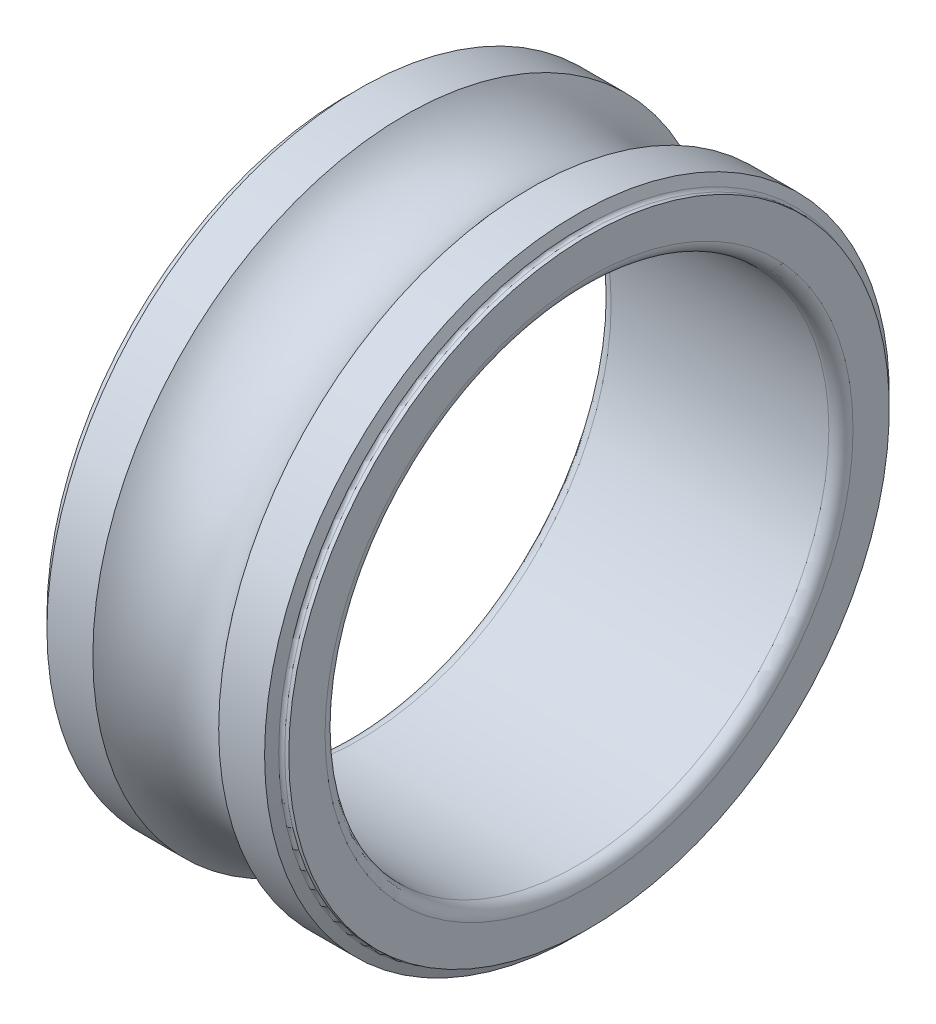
from build123d import *


with BuildPart() as part:
    # Esquisse1 → Base-R_volution (revolve)
    with BuildSketch(Plane.XY, mode=Mode.PRIVATE) as base_r_volution_sk:
        with BuildLine():
            Line((12, 13.1), (12, 14.9))
            Line((12, 14.9), (11.8, 14.9))
            ThreePointArc((11.8, 14.9), (11.691504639, 14.931985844), (11.617712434, 15.017712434))
            Line((11.617712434, 15.017712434), (11.4, 15.5))
            Line((11.4, 15.5), (9.122498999, 15.5))
            ThreePointArc((9.122498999, 15.5), (6, 14), (2.877501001, 15.5))
            Line((2.877501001, 15.5), (0.6, 15.5))
            Line((0.6, 15.5), (0.382287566, 15.017712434))
            ThreePointArc((0.382287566, 15.017712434), (0.308495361, 14.931985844), (0.2, 14.9))
            Line((0.2, 14.9), (0, 14.9))
            Line((0, 14.9), (0, 13.1))
            ThreePointArc((0, 13.1), (0.175735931, 12.675735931), (0.6, 12.5))
            Line((0.6, 12.5), (11.4, 12.5))
            ThreePointArc((11.4, 12.5), (11.824264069, 12.675735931), (12, 13.1))
        make_face()
    revolve(base_r_volution_sk.sketch.rotate(Axis((-13, 0, 0), (1, 0, 0)), 90), axis=Axis((-13, 0, 0), (1, 0, 0)))


solid = part.part
